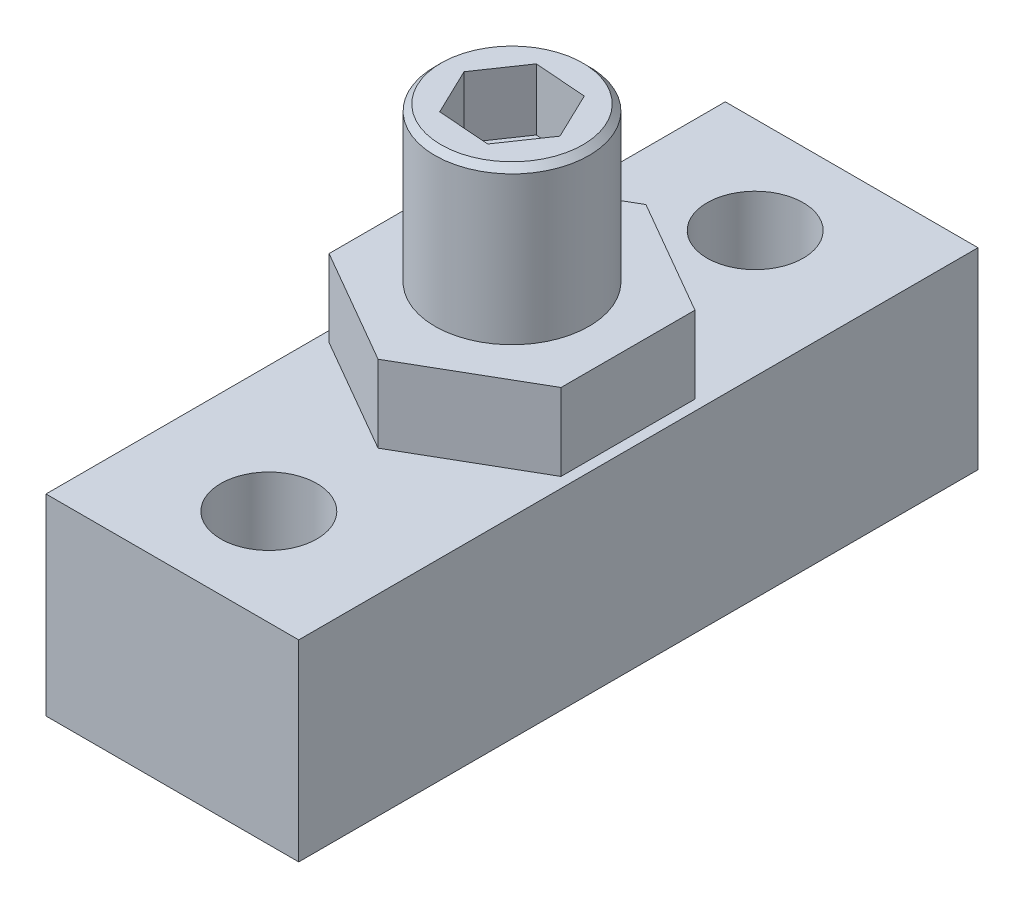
from build123d import *

# Parameters (mm, degrees)
SKETCH1_W          = 10.414
SKETCH1_H          = 27.9908
EXTRUDE1_DEPTH     = 3.9624
SKETCH2_R          = 1.9812
CUT_EXTRUDE1_DEPTH = 17.905221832
EXTRUDE2_DEPTH     = 3.175
SKETCH4_R          = 3.175
EXTRUDE3_DEPTH     = 6.35
CUT_EXTRUDE2_DEPTH = 2.54
CHAMFER1_SIZE      = 0.254


with BuildPart() as part:
    # Sketch1 → Extrude1 (new, symmetric)
    with BuildSketch(Plane(origin=(0, 0, 0), x_dir=(1, 0, 0), z_dir=(0, 1, 0))):
        Rectangle(SKETCH1_W, SKETCH1_H)
    extrude(amount=EXTRUDE1_DEPTH, both=True)

    # Sketch2 → Cut-Extrude1 (cut, through all)
    with BuildSketch(Plane(origin=(0, 3.9624, 0), x_dir=(-1, 0, 0), z_dir=(0, 1, 0))):
        with Locations(Location((0, 10.0203, 0), (0, 0, 90))):
            Circle(SKETCH2_R)
        with Locations(Location((0, -10.0203, 0), (0, 0, 90))):
            Circle(SKETCH2_R)
    extrude(amount=-CUT_EXTRUDE1_DEPTH, mode=Mode.SUBTRACT)

    # Sketch3 → Extrude2 (add)
    with BuildSketch(Plane(origin=(0, 3.9624, 0), x_dir=(-1, 0, 0), z_dir=(0, 1, 0))):
        Polygon((0, 5.518602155), (-4.779249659, 2.759301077), (-4.779249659, -2.759301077), (0, -5.518602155), (4.779249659, -2.759301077), (4.779249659, 2.759301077), align=None)
    extrude(amount=EXTRUDE2_DEPTH)

    # Sketch4 → Extrude3 (add)
    with BuildSketch(Plane(origin=(0, 7.1374, 0), x_dir=(-1, 0, 0), z_dir=(0, 1, 0))):
        with Locations(Location((0, 0, 0), (0, 0, 90))):
            Circle(SKETCH4_R)
    extrude(amount=EXTRUDE3_DEPTH)

    # Sketch5 → Cut-Extrude2 (cut)
    with BuildSketch(Plane(origin=(0, 13.4874, 0), x_dir=(-1, 0, 0), z_dir=(0, 1, 0))):
        Polygon((1.208493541, 1.770187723), (-0.928780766, 1.931679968), (-2.137274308, 0.161492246), (-1.208493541, -1.770187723), (0.928780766, -1.931679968), (2.137274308, -0.161492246), align=None)
    extrude(amount=-CUT_EXTRUDE2_DEPTH, mode=Mode.SUBTRACT)

    # Chamfer1
    chamfer1_edges = [part.edges().sort_by_distance(p)[0] for p in [
        (0, 13.4874, -3.175),
    ]]
    chamfer(chamfer1_edges, length=CHAMFER1_SIZE)


solid = part.part
